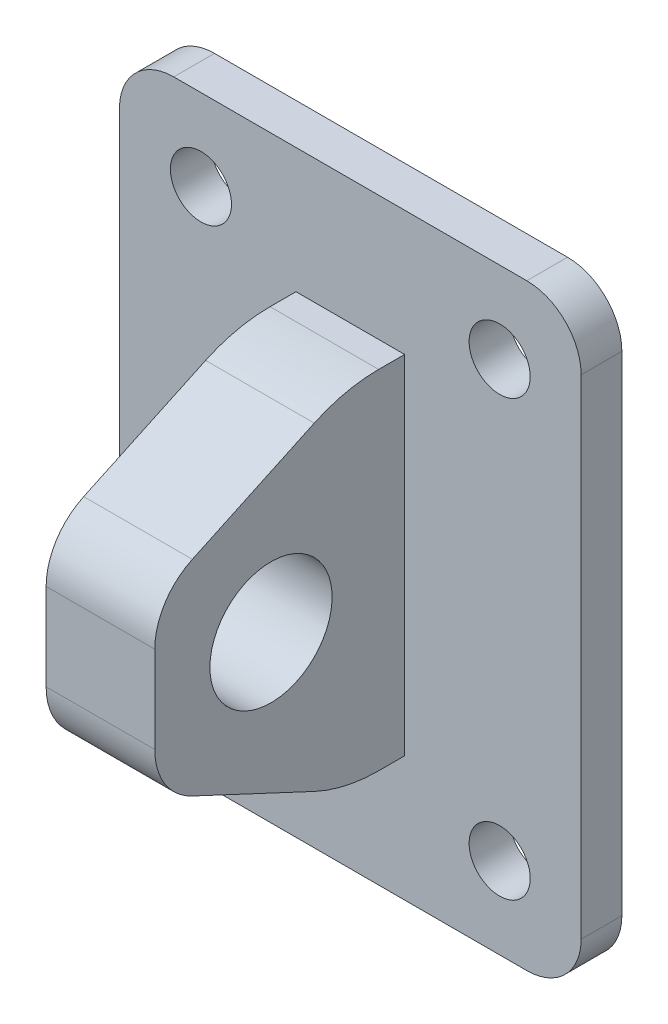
ISO-10303-21;
HEADER;
FILE_DESCRIPTION(('STEP AP214'),'2;1');
FILE_NAME('part.step','',(''),(''),'','','');
FILE_SCHEMA(('AUTOMOTIVE_DESIGN { 1 0 10303 214 1 1 1 1 }'));
ENDSEC;
DATA;
#1=APPLICATION_CONTEXT('core data for automotive mechanical design processes');
#2=APPLICATION_PROTOCOL_DEFINITION('international standard','automotive_design',2000,#1);
#3=PRODUCT_CONTEXT('',#1,'mechanical');
#4=PRODUCT('Part','Part','',(#3));
#5=PRODUCT_RELATED_PRODUCT_CATEGORY('part','',(#4));
#6=PRODUCT_DEFINITION_FORMATION('','',#4);
#7=PRODUCT_DEFINITION_CONTEXT('part definition',#1,'design');
#8=PRODUCT_DEFINITION('design','',#6,#7);
#9=PRODUCT_DEFINITION_SHAPE('','',#8);
#10=(LENGTH_UNIT() NAMED_UNIT(*) SI_UNIT(.MILLI.,.METRE.));
#11=(NAMED_UNIT(*) PLANE_ANGLE_UNIT() SI_UNIT($,.RADIAN.));
#12=(NAMED_UNIT(*) SI_UNIT($,.STERADIAN.) SOLID_ANGLE_UNIT());
#13=UNCERTAINTY_MEASURE_WITH_UNIT(LENGTH_MEASURE(1.E-05),#10,'distance_accuracy_value','');
#14=(GEOMETRIC_REPRESENTATION_CONTEXT(3) GLOBAL_UNCERTAINTY_ASSIGNED_CONTEXT((#13)) GLOBAL_UNIT_ASSIGNED_CONTEXT((#10,
#11,#12)) REPRESENTATION_CONTEXT('',''));
#15=CARTESIAN_POINT('',(0.,0.,0.));
#16=DIRECTION('',(0.,0.,1.));
#17=DIRECTION('',(1.,0.,0.));
#18=AXIS2_PLACEMENT_3D('',#15,#16,#17);
#19=CARTESIAN_POINT('',(53.975,-57.15,0.));
#20=DIRECTION('',(0.,0.,1.));
#21=DIRECTION('',(1.,0.,0.));
#22=AXIS2_PLACEMENT_3D('',#19,#20,#21);
#23=PLANE('',#22);
#24=CARTESIAN_POINT('',(41.275,-57.15,0.));
#25=DIRECTION('',(0.,0.,1.));
#26=DIRECTION('',(1.,0.,0.));
#27=AXIS2_PLACEMENT_3D('',#24,#25,#26);
#28=CIRCLE('',#27,12.7);
#29=CARTESIAN_POINT('',(41.275,-69.85,0.));
#30=VERTEX_POINT('',#29);
#31=CARTESIAN_POINT('',(53.975,-57.15,0.));
#32=VERTEX_POINT('',#31);
#33=EDGE_CURVE('E143',#30,#32,#28,.T.);
#34=ORIENTED_EDGE('',*,*,#33,.T.);
#35=DIRECTION('',(0.,1.,0.));
#36=VECTOR('',#35,1.);
#37=CARTESIAN_POINT('',(53.975,57.15,0.));
#38=LINE('',#37,#36);
#39=CARTESIAN_POINT('',(53.975,57.15,0.));
#40=VERTEX_POINT('',#39);
#41=EDGE_CURVE('E141',#32,#40,#38,.T.);
#42=ORIENTED_EDGE('',*,*,#41,.T.);
#43=CARTESIAN_POINT('',(41.275,57.15,0.));
#44=DIRECTION('',(0.,0.,1.));
#45=DIRECTION('',(-1.,0.,0.));
#46=AXIS2_PLACEMENT_3D('',#43,#44,#45);
#47=CIRCLE('',#46,12.7);
#48=CARTESIAN_POINT('',(41.275,69.85,0.));
#49=VERTEX_POINT('',#48);
#50=EDGE_CURVE('E123',#40,#49,#47,.T.);
#51=ORIENTED_EDGE('',*,*,#50,.T.);
#52=DIRECTION('',(-1.,0.,0.));
#53=VECTOR('',#52,1.);
#54=CARTESIAN_POINT('',(-41.275,69.85,0.));
#55=LINE('',#54,#53);
#56=CARTESIAN_POINT('',(-41.275,69.85,0.));
#57=VERTEX_POINT('',#56);
#58=EDGE_CURVE('E132',#49,#57,#55,.T.);
#59=ORIENTED_EDGE('',*,*,#58,.T.);
#60=CARTESIAN_POINT('',(-41.275,57.15,0.));
#61=DIRECTION('',(0.,0.,1.));
#62=DIRECTION('',(1.,0.,0.));
#63=AXIS2_PLACEMENT_3D('',#60,#61,#62);
#64=CIRCLE('',#63,12.7);
#65=CARTESIAN_POINT('',(-53.975,57.15,0.));
#66=VERTEX_POINT('',#65);
#67=EDGE_CURVE('E137',#57,#66,#64,.T.);
#68=ORIENTED_EDGE('',*,*,#67,.T.);
#69=DIRECTION('',(0.,-1.,0.));
#70=VECTOR('',#69,1.);
#71=CARTESIAN_POINT('',(-53.975,57.15,0.));
#72=LINE('',#71,#70);
#73=CARTESIAN_POINT('',(-53.975,-57.15,0.));
#74=VERTEX_POINT('',#73);
#75=EDGE_CURVE('E266',#66,#74,#72,.T.);
#76=ORIENTED_EDGE('',*,*,#75,.T.);
#77=CARTESIAN_POINT('',(-41.275,-57.15,0.));
#78=DIRECTION('',(0.,0.,1.));
#79=DIRECTION('',(1.,0.,0.));
#80=AXIS2_PLACEMENT_3D('',#77,#78,#79);
#81=CIRCLE('',#80,12.7);
#82=CARTESIAN_POINT('',(-41.275,-69.85,0.));
#83=VERTEX_POINT('',#82);
#84=EDGE_CURVE('E273',#74,#83,#81,.T.);
#85=ORIENTED_EDGE('',*,*,#84,.T.);
#86=DIRECTION('',(1.,0.,0.));
#87=VECTOR('',#86,1.);
#88=CARTESIAN_POINT('',(-41.275,-69.85,0.));
#89=LINE('',#88,#87);
#90=EDGE_CURVE('E167',#83,#30,#89,.T.);
#91=ORIENTED_EDGE('',*,*,#90,.T.);
#92=EDGE_LOOP('',(#34,#42,#51,#59,#68,#76,#85,#91));
#93=FACE_BOUND('',#92,.T.);
#94=CARTESIAN_POINT('',(-34.925,50.8,0.));
#95=DIRECTION('',(0.,0.,1.));
#96=DIRECTION('',(1.,0.,0.));
#97=AXIS2_PLACEMENT_3D('',#94,#95,#96);
#98=CIRCLE('',#97,7.14375);
#99=CARTESIAN_POINT('',(-27.78125,50.8,0.));
#100=VERTEX_POINT('',#99);
#101=EDGE_CURVE('E168',#100,#100,#98,.T.);
#102=ORIENTED_EDGE('',*,*,#101,.F.);
#103=EDGE_LOOP('',(#102));
#104=FACE_BOUND('',#103,.T.);
#105=CARTESIAN_POINT('',(34.925,50.8,0.));
#106=DIRECTION('',(0.,0.,1.));
#107=DIRECTION('',(1.,0.,0.));
#108=AXIS2_PLACEMENT_3D('',#105,#106,#107);
#109=CIRCLE('',#108,7.14375);
#110=CARTESIAN_POINT('',(42.06875,50.8,0.));
#111=VERTEX_POINT('',#110);
#112=EDGE_CURVE('E174',#111,#111,#109,.T.);
#113=ORIENTED_EDGE('',*,*,#112,.F.);
#114=EDGE_LOOP('',(#113));
#115=FACE_BOUND('',#114,.T.);
#116=CARTESIAN_POINT('',(-34.925,-50.8,0.));
#117=DIRECTION('',(0.,0.,1.));
#118=DIRECTION('',(1.,0.,0.));
#119=AXIS2_PLACEMENT_3D('',#116,#117,#118);
#120=CIRCLE('',#119,7.14375);
#121=CARTESIAN_POINT('',(-27.78125,-50.8,0.));
#122=VERTEX_POINT('',#121);
#123=EDGE_CURVE('E180',#122,#122,#120,.T.);
#124=ORIENTED_EDGE('',*,*,#123,.F.);
#125=EDGE_LOOP('',(#124));
#126=FACE_BOUND('',#125,.T.);
#127=CARTESIAN_POINT('',(34.925,-50.8,0.));
#128=DIRECTION('',(0.,0.,1.));
#129=DIRECTION('',(1.,0.,0.));
#130=AXIS2_PLACEMENT_3D('',#127,#128,#129);
#131=CIRCLE('',#130,7.14375);
#132=CARTESIAN_POINT('',(42.06875,-50.8,0.));
#133=VERTEX_POINT('',#132);
#134=EDGE_CURVE('E13',#133,#133,#131,.T.);
#135=ORIENTED_EDGE('',*,*,#134,.F.);
#136=EDGE_LOOP('',(#135));
#137=FACE_BOUND('',#136,.T.);
#138=ADVANCED_FACE('F49',(#93,#104,#115,#126,#137),#23,.T.);
#139=CARTESIAN_POINT('',(41.275,-57.15,-9.525));
#140=DIRECTION('',(0.,0.,1.));
#141=DIRECTION('',(1.,0.,0.));
#142=AXIS2_PLACEMENT_3D('',#139,#140,#141);
#143=CYLINDRICAL_SURFACE('',#142,12.7);
#144=ORIENTED_EDGE('',*,*,#33,.F.);
#145=DIRECTION('',(0.,0.,1.));
#146=VECTOR('',#145,1.);
#147=CARTESIAN_POINT('',(41.275,-69.85,-9.525));
#148=LINE('',#147,#146);
#149=CARTESIAN_POINT('',(41.275,-69.85,-9.525));
#150=VERTEX_POINT('',#149);
#151=EDGE_CURVE('E106',#150,#30,#148,.T.);
#152=ORIENTED_EDGE('',*,*,#151,.F.);
#153=CARTESIAN_POINT('',(41.275,-57.15,-9.525));
#154=DIRECTION('',(0.,0.,1.));
#155=DIRECTION('',(1.,0.,0.));
#156=AXIS2_PLACEMENT_3D('',#153,#154,#155);
#157=CIRCLE('',#156,12.7);
#158=CARTESIAN_POINT('',(53.975,-57.15,-9.525));
#159=VERTEX_POINT('',#158);
#160=EDGE_CURVE('E165',#150,#159,#157,.T.);
#161=ORIENTED_EDGE('',*,*,#160,.T.);
#162=DIRECTION('',(0.,0.,1.));
#163=VECTOR('',#162,1.);
#164=CARTESIAN_POINT('',(53.975,-57.15,-9.525));
#165=LINE('',#164,#163);
#166=EDGE_CURVE('E65',#159,#32,#165,.T.);
#167=ORIENTED_EDGE('',*,*,#166,.T.);
#168=EDGE_LOOP('',(#144,#152,#161,#167));
#169=FACE_BOUND('',#168,.T.);
#170=ADVANCED_FACE('F199',(#169),#143,.T.);
#171=CARTESIAN_POINT('',(-41.275,-69.85,-9.525));
#172=DIRECTION('',(0.,-1.,0.));
#173=DIRECTION('',(0.,0.,-1.));
#174=AXIS2_PLACEMENT_3D('',#171,#172,#173);
#175=PLANE('',#174);
#176=ORIENTED_EDGE('',*,*,#90,.F.);
#177=DIRECTION('',(0.,0.,1.));
#178=VECTOR('',#177,1.);
#179=CARTESIAN_POINT('',(-41.275,-69.85,-9.525));
#180=LINE('',#179,#178);
#181=CARTESIAN_POINT('',(-41.275,-69.85,-9.525));
#182=VERTEX_POINT('',#181);
#183=EDGE_CURVE('E255',#182,#83,#180,.T.);
#184=ORIENTED_EDGE('',*,*,#183,.F.);
#185=DIRECTION('',(1.,0.,0.));
#186=VECTOR('',#185,1.);
#187=CARTESIAN_POINT('',(-41.275,-69.85,-9.525));
#188=LINE('',#187,#186);
#189=EDGE_CURVE('E149',#182,#150,#188,.T.);
#190=ORIENTED_EDGE('',*,*,#189,.T.);
#191=ORIENTED_EDGE('',*,*,#151,.T.);
#192=EDGE_LOOP('',(#176,#184,#190,#191));
#193=FACE_BOUND('',#192,.T.);
#194=ADVANCED_FACE('F208',(#193),#175,.T.);
#195=CARTESIAN_POINT('',(-41.275,-57.15,-9.525));
#196=DIRECTION('',(0.,0.,1.));
#197=DIRECTION('',(1.,0.,0.));
#198=AXIS2_PLACEMENT_3D('',#195,#196,#197);
#199=CYLINDRICAL_SURFACE('',#198,12.7);
#200=ORIENTED_EDGE('',*,*,#84,.F.);
#201=DIRECTION('',(0.,0.,1.));
#202=VECTOR('',#201,1.);
#203=CARTESIAN_POINT('',(-53.975,-57.15,-9.525));
#204=LINE('',#203,#202);
#205=CARTESIAN_POINT('',(-53.975,-57.15,-9.525));
#206=VERTEX_POINT('',#205);
#207=EDGE_CURVE('E259',#206,#74,#204,.T.);
#208=ORIENTED_EDGE('',*,*,#207,.F.);
#209=CARTESIAN_POINT('',(-41.275,-57.15,-9.525));
#210=DIRECTION('',(0.,0.,1.));
#211=DIRECTION('',(1.,0.,0.));
#212=AXIS2_PLACEMENT_3D('',#209,#210,#211);
#213=CIRCLE('',#212,12.7);
#214=EDGE_CURVE('E151',#206,#182,#213,.T.);
#215=ORIENTED_EDGE('',*,*,#214,.T.);
#216=ORIENTED_EDGE('',*,*,#183,.T.);
#217=EDGE_LOOP('',(#200,#208,#215,#216));
#218=FACE_BOUND('',#217,.T.);
#219=ADVANCED_FACE('F213',(#218),#199,.T.);
#220=CARTESIAN_POINT('',(-53.975,57.15,-9.525));
#221=DIRECTION('',(-1.,0.,0.));
#222=DIRECTION('',(0.,0.,1.));
#223=AXIS2_PLACEMENT_3D('',#220,#221,#222);
#224=PLANE('',#223);
#225=ORIENTED_EDGE('',*,*,#75,.F.);
#226=DIRECTION('',(0.,0.,1.));
#227=VECTOR('',#226,1.);
#228=CARTESIAN_POINT('',(-53.975,57.15,-9.525));
#229=LINE('',#228,#227);
#230=CARTESIAN_POINT('',(-53.975,57.15,-9.525));
#231=VERTEX_POINT('',#230);
#232=EDGE_CURVE('E264',#231,#66,#229,.T.);
#233=ORIENTED_EDGE('',*,*,#232,.F.);
#234=DIRECTION('',(0.,-1.,0.));
#235=VECTOR('',#234,1.);
#236=CARTESIAN_POINT('',(-53.975,57.15,-9.525));
#237=LINE('',#236,#235);
#238=EDGE_CURVE('E154',#231,#206,#237,.T.);
#239=ORIENTED_EDGE('',*,*,#238,.T.);
#240=ORIENTED_EDGE('',*,*,#207,.T.);
#241=EDGE_LOOP('',(#225,#233,#239,#240));
#242=FACE_BOUND('',#241,.T.);
#243=ADVANCED_FACE('F226',(#242),#224,.T.);
#244=CARTESIAN_POINT('',(-41.275,57.15,-9.525));
#245=DIRECTION('',(0.,0.,1.));
#246=DIRECTION('',(1.,0.,0.));
#247=AXIS2_PLACEMENT_3D('',#244,#245,#246);
#248=CYLINDRICAL_SURFACE('',#247,12.7);
#249=ORIENTED_EDGE('',*,*,#67,.F.);
#250=DIRECTION('',(0.,0.,1.));
#251=VECTOR('',#250,1.);
#252=CARTESIAN_POINT('',(-41.275,69.85,-9.525));
#253=LINE('',#252,#251);
#254=CARTESIAN_POINT('',(-41.275,69.85,-9.525));
#255=VERTEX_POINT('',#254);
#256=EDGE_CURVE('E129',#255,#57,#253,.T.);
#257=ORIENTED_EDGE('',*,*,#256,.F.);
#258=CARTESIAN_POINT('',(-41.275,57.15,-9.525));
#259=DIRECTION('',(0.,0.,1.));
#260=DIRECTION('',(1.,0.,0.));
#261=AXIS2_PLACEMENT_3D('',#258,#259,#260);
#262=CIRCLE('',#261,12.7);
#263=EDGE_CURVE('E157',#255,#231,#262,.T.);
#264=ORIENTED_EDGE('',*,*,#263,.T.);
#265=ORIENTED_EDGE('',*,*,#232,.T.);
#266=EDGE_LOOP('',(#249,#257,#264,#265));
#267=FACE_BOUND('',#266,.T.);
#268=ADVANCED_FACE('F223',(#267),#248,.T.);
#269=CARTESIAN_POINT('',(-41.275,69.85,-9.525));
#270=DIRECTION('',(0.,1.,0.));
#271=DIRECTION('',(0.,0.,1.));
#272=AXIS2_PLACEMENT_3D('',#269,#270,#271);
#273=PLANE('',#272);
#274=ORIENTED_EDGE('',*,*,#58,.F.);
#275=DIRECTION('',(0.,0.,1.));
#276=VECTOR('',#275,1.);
#277=CARTESIAN_POINT('',(41.275,69.85,-9.525));
#278=LINE('',#277,#276);
#279=CARTESIAN_POINT('',(41.275,69.85,-9.525));
#280=VERTEX_POINT('',#279);
#281=EDGE_CURVE('E119',#280,#49,#278,.T.);
#282=ORIENTED_EDGE('',*,*,#281,.F.);
#283=DIRECTION('',(-1.,0.,0.));
#284=VECTOR('',#283,1.);
#285=CARTESIAN_POINT('',(-41.275,69.85,-9.525));
#286=LINE('',#285,#284);
#287=EDGE_CURVE('E160',#280,#255,#286,.T.);
#288=ORIENTED_EDGE('',*,*,#287,.T.);
#289=ORIENTED_EDGE('',*,*,#256,.T.);
#290=EDGE_LOOP('',(#274,#282,#288,#289));
#291=FACE_BOUND('',#290,.T.);
#292=ADVANCED_FACE('F133',(#291),#273,.T.);
#293=CARTESIAN_POINT('',(41.275,57.15,-9.525));
#294=DIRECTION('',(0.,0.,1.));
#295=DIRECTION('',(1.,0.,0.));
#296=AXIS2_PLACEMENT_3D('',#293,#294,#295);
#297=CYLINDRICAL_SURFACE('',#296,12.7);
#298=ORIENTED_EDGE('',*,*,#50,.F.);
#299=DIRECTION('',(0.,0.,1.));
#300=VECTOR('',#299,1.);
#301=CARTESIAN_POINT('',(53.975,57.15,-9.525));
#302=LINE('',#301,#300);
#303=CARTESIAN_POINT('',(53.975,57.15,-9.525));
#304=VERTEX_POINT('',#303);
#305=EDGE_CURVE('E94',#304,#40,#302,.T.);
#306=ORIENTED_EDGE('',*,*,#305,.F.);
#307=CARTESIAN_POINT('',(41.275,57.15,-9.525));
#308=DIRECTION('',(0.,0.,1.));
#309=DIRECTION('',(-1.,0.,0.));
#310=AXIS2_PLACEMENT_3D('',#307,#308,#309);
#311=CIRCLE('',#310,12.7);
#312=EDGE_CURVE('E125',#304,#280,#311,.T.);
#313=ORIENTED_EDGE('',*,*,#312,.T.);
#314=ORIENTED_EDGE('',*,*,#281,.T.);
#315=EDGE_LOOP('',(#298,#306,#313,#314));
#316=FACE_BOUND('',#315,.T.);
#317=ADVANCED_FACE('F121',(#316),#297,.T.);
#318=CARTESIAN_POINT('',(53.975,57.15,-9.525));
#319=DIRECTION('',(1.,0.,0.));
#320=DIRECTION('',(0.,0.,-1.));
#321=AXIS2_PLACEMENT_3D('',#318,#319,#320);
#322=PLANE('',#321);
#323=ORIENTED_EDGE('',*,*,#41,.F.);
#324=ORIENTED_EDGE('',*,*,#166,.F.);
#325=DIRECTION('',(0.,1.,0.));
#326=VECTOR('',#325,1.);
#327=CARTESIAN_POINT('',(53.975,57.15,-9.525));
#328=LINE('',#327,#326);
#329=EDGE_CURVE('E163',#159,#304,#328,.T.);
#330=ORIENTED_EDGE('',*,*,#329,.T.);
#331=ORIENTED_EDGE('',*,*,#305,.T.);
#332=EDGE_LOOP('',(#323,#324,#330,#331));
#333=FACE_BOUND('',#332,.T.);
#334=ADVANCED_FACE('F216',(#333),#322,.T.);
#335=CARTESIAN_POINT('',(41.275,-57.15,-9.525));
#336=DIRECTION('',(0.,0.,1.));
#337=DIRECTION('',(1.,0.,0.));
#338=AXIS2_PLACEMENT_3D('',#335,#336,#337);
#339=PLANE('',#338);
#340=CARTESIAN_POINT('',(34.925,-50.8,-9.525));
#341=DIRECTION('',(0.,0.,1.));
#342=DIRECTION('',(1.,0.,0.));
#343=AXIS2_PLACEMENT_3D('',#340,#341,#342);
#344=CIRCLE('',#343,7.14375);
#345=CARTESIAN_POINT('',(42.06875,-50.8,-9.525));
#346=VERTEX_POINT('',#345);
#347=EDGE_CURVE('E52',#346,#346,#344,.T.);
#348=ORIENTED_EDGE('',*,*,#347,.T.);
#349=EDGE_LOOP('',(#348));
#350=FACE_BOUND('',#349,.T.);
#351=CARTESIAN_POINT('',(-34.925,-50.8,-9.525));
#352=DIRECTION('',(0.,0.,1.));
#353=DIRECTION('',(1.,0.,0.));
#354=AXIS2_PLACEMENT_3D('',#351,#352,#353);
#355=CIRCLE('',#354,7.14375);
#356=CARTESIAN_POINT('',(-27.78125,-50.8,-9.525));
#357=VERTEX_POINT('',#356);
#358=EDGE_CURVE('E177',#357,#357,#355,.T.);
#359=ORIENTED_EDGE('',*,*,#358,.T.);
#360=EDGE_LOOP('',(#359));
#361=FACE_BOUND('',#360,.T.);
#362=CARTESIAN_POINT('',(34.925,50.8,-9.525));
#363=DIRECTION('',(0.,0.,1.));
#364=DIRECTION('',(1.,0.,0.));
#365=AXIS2_PLACEMENT_3D('',#362,#363,#364);
#366=CIRCLE('',#365,7.14375);
#367=CARTESIAN_POINT('',(42.06875,50.8,-9.525));
#368=VERTEX_POINT('',#367);
#369=EDGE_CURVE('E171',#368,#368,#366,.T.);
#370=ORIENTED_EDGE('',*,*,#369,.T.);
#371=EDGE_LOOP('',(#370));
#372=FACE_BOUND('',#371,.T.);
#373=CARTESIAN_POINT('',(-34.925,50.8,-9.525));
#374=DIRECTION('',(0.,0.,1.));
#375=DIRECTION('',(1.,0.,0.));
#376=AXIS2_PLACEMENT_3D('',#373,#374,#375);
#377=CIRCLE('',#376,7.14375);
#378=CARTESIAN_POINT('',(-27.78125,50.8,-9.525));
#379=VERTEX_POINT('',#378);
#380=EDGE_CURVE('E148',#379,#379,#377,.T.);
#381=ORIENTED_EDGE('',*,*,#380,.T.);
#382=EDGE_LOOP('',(#381));
#383=FACE_BOUND('',#382,.T.);
#384=ORIENTED_EDGE('',*,*,#160,.F.);
#385=ORIENTED_EDGE('',*,*,#189,.F.);
#386=ORIENTED_EDGE('',*,*,#214,.F.);
#387=ORIENTED_EDGE('',*,*,#238,.F.);
#388=ORIENTED_EDGE('',*,*,#263,.F.);
#389=ORIENTED_EDGE('',*,*,#287,.F.);
#390=ORIENTED_EDGE('',*,*,#312,.F.);
#391=ORIENTED_EDGE('',*,*,#329,.F.);
#392=EDGE_LOOP('',(#384,#385,#386,#387,#388,#389,#390,#391));
#393=FACE_BOUND('',#392,.T.);
#394=ADVANCED_FACE('F186',(#350,#361,#372,#383,#393),#339,.F.);
#395=CARTESIAN_POINT('',(-34.925,50.8,-9.525));
#396=DIRECTION('',(0.,0.,1.));
#397=DIRECTION('',(1.,0.,0.));
#398=AXIS2_PLACEMENT_3D('',#395,#396,#397);
#399=CYLINDRICAL_SURFACE('',#398,7.14375);
#400=CARTESIAN_POINT('',(-27.78125,50.8,-9.525));
#401=CARTESIAN_POINT('',(-27.78125,50.8,-9.42578125));
#402=CARTESIAN_POINT('',(-27.78125,50.8,-9.3265625));
#403=CARTESIAN_POINT('',(-27.78125,50.8,-9.128125));
#404=CARTESIAN_POINT('',(-27.78125,50.8,-9.02890625));
#405=CARTESIAN_POINT('',(-27.78125,50.8,-8.83046875));
#406=CARTESIAN_POINT('',(-27.78125,50.8,-8.73125));
#407=CARTESIAN_POINT('',(-27.78125,50.8,-8.5328125));
#408=CARTESIAN_POINT('',(-27.78125,50.8,-8.43359375));
#409=CARTESIAN_POINT('',(-27.78125,50.8,-8.23515625));
#410=CARTESIAN_POINT('',(-27.78125,50.8,-8.1359375));
#411=CARTESIAN_POINT('',(-27.78125,50.8,-7.9375));
#412=CARTESIAN_POINT('',(-27.78125,50.8,-7.83828125));
#413=CARTESIAN_POINT('',(-27.78125,50.8,-7.63984375));
#414=CARTESIAN_POINT('',(-27.78125,50.8,-7.540625));
#415=CARTESIAN_POINT('',(-27.78125,50.8,-7.3421875));
#416=CARTESIAN_POINT('',(-27.78125,50.8,-7.24296875));
#417=CARTESIAN_POINT('',(-27.78125,50.8,-7.04453125));
#418=CARTESIAN_POINT('',(-27.78125,50.8,-6.9453125));
#419=CARTESIAN_POINT('',(-27.78125,50.8,-6.746875));
#420=CARTESIAN_POINT('',(-27.78125,50.8,-6.64765625));
#421=CARTESIAN_POINT('',(-27.78125,50.8,-6.44921875));
#422=CARTESIAN_POINT('',(-27.78125,50.8,-6.35));
#423=CARTESIAN_POINT('',(-27.78125,50.8,-6.1515625));
#424=CARTESIAN_POINT('',(-27.78125,50.8,-6.05234375));
#425=CARTESIAN_POINT('',(-27.78125,50.8,-5.85390625));
#426=CARTESIAN_POINT('',(-27.78125,50.8,-5.7546875));
#427=CARTESIAN_POINT('',(-27.78125,50.8,-5.55625));
#428=CARTESIAN_POINT('',(-27.78125,50.8,-5.45703125));
#429=CARTESIAN_POINT('',(-27.78125,50.8,-5.25859375));
#430=CARTESIAN_POINT('',(-27.78125,50.8,-5.159375));
#431=CARTESIAN_POINT('',(-27.78125,50.8,-4.9609375));
#432=CARTESIAN_POINT('',(-27.78125,50.8,-4.86171875));
#433=CARTESIAN_POINT('',(-27.78125,50.8,-4.66328125));
#434=CARTESIAN_POINT('',(-27.78125,50.8,-4.5640625));
#435=CARTESIAN_POINT('',(-27.78125,50.8,-4.365625));
#436=CARTESIAN_POINT('',(-27.78125,50.8,-4.26640625));
#437=CARTESIAN_POINT('',(-27.78125,50.8,-4.06796875));
#438=CARTESIAN_POINT('',(-27.78125,50.8,-3.96875));
#439=CARTESIAN_POINT('',(-27.78125,50.8,-3.7703125));
#440=CARTESIAN_POINT('',(-27.78125,50.8,-3.67109375));
#441=CARTESIAN_POINT('',(-27.78125,50.8,-3.47265625));
#442=CARTESIAN_POINT('',(-27.78125,50.8,-3.3734375));
#443=CARTESIAN_POINT('',(-27.78125,50.8,-3.175));
#444=CARTESIAN_POINT('',(-27.78125,50.8,-3.07578125));
#445=CARTESIAN_POINT('',(-27.78125,50.8,-2.87734375));
#446=CARTESIAN_POINT('',(-27.78125,50.8,-2.778125));
#447=CARTESIAN_POINT('',(-27.78125,50.8,-2.5796875));
#448=CARTESIAN_POINT('',(-27.78125,50.8,-2.48046875));
#449=CARTESIAN_POINT('',(-27.78125,50.8,-2.28203125));
#450=CARTESIAN_POINT('',(-27.78125,50.8,-2.1828125));
#451=CARTESIAN_POINT('',(-27.78125,50.8,-1.984375));
#452=CARTESIAN_POINT('',(-27.78125,50.8,-1.88515625));
#453=CARTESIAN_POINT('',(-27.78125,50.8,-1.68671875));
#454=CARTESIAN_POINT('',(-27.78125,50.8,-1.5875));
#455=CARTESIAN_POINT('',(-27.78125,50.8,-1.3890625));
#456=CARTESIAN_POINT('',(-27.78125,50.8,-1.28984375));
#457=CARTESIAN_POINT('',(-27.78125,50.8,-1.09140625));
#458=CARTESIAN_POINT('',(-27.78125,50.8,-0.992187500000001));
#459=CARTESIAN_POINT('',(-27.78125,50.8,-0.793750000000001));
#460=CARTESIAN_POINT('',(-27.78125,50.8,-0.69453125));
#461=CARTESIAN_POINT('',(-27.78125,50.8,-0.49609375));
#462=CARTESIAN_POINT('',(-27.78125,50.8,-0.396875));
#463=CARTESIAN_POINT('',(-27.78125,50.8,-0.1984375));
#464=CARTESIAN_POINT('',(-27.78125,50.8,-0.0992187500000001));
#465=CARTESIAN_POINT('',(-27.78125,50.8,0.));
#466=B_SPLINE_CURVE_WITH_KNOTS('',3,(#400,#401,#402,#403,#404,#405,#406,#407,#408,#409,#410,
#411,#412,#413,#414,#415,#416,#417,#418,#419,#420,#421,#422,#423,#424,#425,#426,#427,#428,#429,
#430,#431,#432,#433,#434,#435,#436,#437,#438,#439,#440,#441,#442,#443,#444,#445,#446,#447,#448,
#449,#450,#451,#452,#453,#454,#455,#456,#457,#458,#459,#460,#461,#462,#463,#464,#465),
.UNSPECIFIED.,.F.,.F.,(4,2,2,2,2,2,2,2,2,2,2,2,2,2,2,2,2,2,2,2,2,2,2,2,2,2,2,2,2,2,2,2,4),(0.,
0.297656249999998,0.595312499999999,0.892968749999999,1.190625,1.48828125,1.7859375,2.08359375,
2.38125,2.67890625,2.9765625,3.27421875,3.571875,3.86953125,4.1671875,4.46484375,4.7625,
5.06015625,5.3578125,5.65546875,5.953125,6.25078125,6.5484375,6.84609375,7.14375,7.44140625,
7.7390625,8.03671875,8.334375,8.63203125,8.9296875,9.22734375,9.525),.UNSPECIFIED.);
#467=EDGE_CURVE('BSEAM236',#379,#100,#466,.T.);
#468=ORIENTED_EDGE('',*,*,#380,.F.);
#469=ORIENTED_EDGE('',*,*,#101,.T.);
#470=ORIENTED_EDGE('',*,*,#467,.T.);
#471=ORIENTED_EDGE('',*,*,#467,.F.);
#472=EDGE_LOOP('',(#468,#470,#469,#471));
#473=FACE_BOUND('',#472,.T.);
#474=ADVANCED_FACE('F236',(#473),#399,.F.);
#475=CARTESIAN_POINT('',(34.925,50.8,-9.525));
#476=DIRECTION('',(0.,0.,1.));
#477=DIRECTION('',(1.,0.,0.));
#478=AXIS2_PLACEMENT_3D('',#475,#476,#477);
#479=CYLINDRICAL_SURFACE('',#478,7.14375);
#480=CARTESIAN_POINT('',(42.06875,50.8,-9.525));
#481=CARTESIAN_POINT('',(42.06875,50.8,-9.42578125));
#482=CARTESIAN_POINT('',(42.06875,50.8,-9.3265625));
#483=CARTESIAN_POINT('',(42.06875,50.8,-9.128125));
#484=CARTESIAN_POINT('',(42.06875,50.8,-9.02890625));
#485=CARTESIAN_POINT('',(42.06875,50.8,-8.83046875));
#486=CARTESIAN_POINT('',(42.06875,50.8,-8.73125));
#487=CARTESIAN_POINT('',(42.06875,50.8,-8.5328125));
#488=CARTESIAN_POINT('',(42.06875,50.8,-8.43359375));
#489=CARTESIAN_POINT('',(42.06875,50.8,-8.23515625));
#490=CARTESIAN_POINT('',(42.06875,50.8,-8.1359375));
#491=CARTESIAN_POINT('',(42.06875,50.8,-7.9375));
#492=CARTESIAN_POINT('',(42.06875,50.8,-7.83828125));
#493=CARTESIAN_POINT('',(42.06875,50.8,-7.63984375));
#494=CARTESIAN_POINT('',(42.06875,50.8,-7.540625));
#495=CARTESIAN_POINT('',(42.06875,50.8,-7.3421875));
#496=CARTESIAN_POINT('',(42.06875,50.8,-7.24296875));
#497=CARTESIAN_POINT('',(42.06875,50.8,-7.04453125));
#498=CARTESIAN_POINT('',(42.06875,50.8,-6.9453125));
#499=CARTESIAN_POINT('',(42.06875,50.8,-6.746875));
#500=CARTESIAN_POINT('',(42.06875,50.8,-6.64765625));
#501=CARTESIAN_POINT('',(42.06875,50.8,-6.44921875));
#502=CARTESIAN_POINT('',(42.06875,50.8,-6.35));
#503=CARTESIAN_POINT('',(42.06875,50.8,-6.1515625));
#504=CARTESIAN_POINT('',(42.06875,50.8,-6.05234375));
#505=CARTESIAN_POINT('',(42.06875,50.8,-5.85390625));
#506=CARTESIAN_POINT('',(42.06875,50.8,-5.7546875));
#507=CARTESIAN_POINT('',(42.06875,50.8,-5.55625));
#508=CARTESIAN_POINT('',(42.06875,50.8,-5.45703125));
#509=CARTESIAN_POINT('',(42.06875,50.8,-5.25859375));
#510=CARTESIAN_POINT('',(42.06875,50.8,-5.159375));
#511=CARTESIAN_POINT('',(42.06875,50.8,-4.9609375));
#512=CARTESIAN_POINT('',(42.06875,50.8,-4.86171875));
#513=CARTESIAN_POINT('',(42.06875,50.8,-4.66328125));
#514=CARTESIAN_POINT('',(42.06875,50.8,-4.5640625));
#515=CARTESIAN_POINT('',(42.06875,50.8,-4.365625));
#516=CARTESIAN_POINT('',(42.06875,50.8,-4.26640625));
#517=CARTESIAN_POINT('',(42.06875,50.8,-4.06796875));
#518=CARTESIAN_POINT('',(42.06875,50.8,-3.96875));
#519=CARTESIAN_POINT('',(42.06875,50.8,-3.7703125));
#520=CARTESIAN_POINT('',(42.06875,50.8,-3.67109375));
#521=CARTESIAN_POINT('',(42.06875,50.8,-3.47265625));
#522=CARTESIAN_POINT('',(42.06875,50.8,-3.3734375));
#523=CARTESIAN_POINT('',(42.06875,50.8,-3.175));
#524=CARTESIAN_POINT('',(42.06875,50.8,-3.07578125));
#525=CARTESIAN_POINT('',(42.06875,50.8,-2.87734375));
#526=CARTESIAN_POINT('',(42.06875,50.8,-2.778125));
#527=CARTESIAN_POINT('',(42.06875,50.8,-2.5796875));
#528=CARTESIAN_POINT('',(42.06875,50.8,-2.48046875));
#529=CARTESIAN_POINT('',(42.06875,50.8,-2.28203125));
#530=CARTESIAN_POINT('',(42.06875,50.8,-2.1828125));
#531=CARTESIAN_POINT('',(42.06875,50.8,-1.984375));
#532=CARTESIAN_POINT('',(42.06875,50.8,-1.88515625));
#533=CARTESIAN_POINT('',(42.06875,50.8,-1.68671875));
#534=CARTESIAN_POINT('',(42.06875,50.8,-1.5875));
#535=CARTESIAN_POINT('',(42.06875,50.8,-1.3890625));
#536=CARTESIAN_POINT('',(42.06875,50.8,-1.28984375));
#537=CARTESIAN_POINT('',(42.06875,50.8,-1.09140625));
#538=CARTESIAN_POINT('',(42.06875,50.8,-0.992187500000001));
#539=CARTESIAN_POINT('',(42.06875,50.8,-0.793750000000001));
#540=CARTESIAN_POINT('',(42.06875,50.8,-0.69453125));
#541=CARTESIAN_POINT('',(42.06875,50.8,-0.49609375));
#542=CARTESIAN_POINT('',(42.06875,50.8,-0.396875));
#543=CARTESIAN_POINT('',(42.06875,50.8,-0.1984375));
#544=CARTESIAN_POINT('',(42.06875,50.8,-0.0992187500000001));
#545=CARTESIAN_POINT('',(42.06875,50.8,0.));
#546=B_SPLINE_CURVE_WITH_KNOTS('',3,(#480,#481,#482,#483,#484,#485,#486,#487,#488,#489,#490,
#491,#492,#493,#494,#495,#496,#497,#498,#499,#500,#501,#502,#503,#504,#505,#506,#507,#508,#509,
#510,#511,#512,#513,#514,#515,#516,#517,#518,#519,#520,#521,#522,#523,#524,#525,#526,#527,#528,
#529,#530,#531,#532,#533,#534,#535,#536,#537,#538,#539,#540,#541,#542,#543,#544,#545),
.UNSPECIFIED.,.F.,.F.,(4,2,2,2,2,2,2,2,2,2,2,2,2,2,2,2,2,2,2,2,2,2,2,2,2,2,2,2,2,2,2,2,4),(0.,
0.297656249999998,0.595312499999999,0.892968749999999,1.190625,1.48828125,1.7859375,2.08359375,
2.38125,2.67890625,2.9765625,3.27421875,3.571875,3.86953125,4.1671875,4.46484375,4.7625,
5.06015625,5.3578125,5.65546875,5.953125,6.25078125,6.5484375,6.84609375,7.14375,7.44140625,
7.7390625,8.03671875,8.334375,8.63203125,8.9296875,9.22734375,9.525),.UNSPECIFIED.);
#547=EDGE_CURVE('BSEAM193',#368,#111,#546,.T.);
#548=ORIENTED_EDGE('',*,*,#369,.F.);
#549=ORIENTED_EDGE('',*,*,#112,.T.);
#550=ORIENTED_EDGE('',*,*,#547,.T.);
#551=ORIENTED_EDGE('',*,*,#547,.F.);
#552=EDGE_LOOP('',(#548,#550,#549,#551));
#553=FACE_BOUND('',#552,.T.);
#554=ADVANCED_FACE('F193',(#553),#479,.F.);
#555=CARTESIAN_POINT('',(-34.925,-50.8,-9.525));
#556=DIRECTION('',(0.,0.,1.));
#557=DIRECTION('',(1.,0.,0.));
#558=AXIS2_PLACEMENT_3D('',#555,#556,#557);
#559=CYLINDRICAL_SURFACE('',#558,7.14375);
#560=CARTESIAN_POINT('',(-27.78125,-50.8,-9.525));
#561=CARTESIAN_POINT('',(-27.78125,-50.8,-9.42578125));
#562=CARTESIAN_POINT('',(-27.78125,-50.8,-9.3265625));
#563=CARTESIAN_POINT('',(-27.78125,-50.8,-9.128125));
#564=CARTESIAN_POINT('',(-27.78125,-50.8,-9.02890625));
#565=CARTESIAN_POINT('',(-27.78125,-50.8,-8.83046875));
#566=CARTESIAN_POINT('',(-27.78125,-50.8,-8.73125));
#567=CARTESIAN_POINT('',(-27.78125,-50.8,-8.5328125));
#568=CARTESIAN_POINT('',(-27.78125,-50.8,-8.43359375));
#569=CARTESIAN_POINT('',(-27.78125,-50.8,-8.23515625));
#570=CARTESIAN_POINT('',(-27.78125,-50.8,-8.1359375));
#571=CARTESIAN_POINT('',(-27.78125,-50.8,-7.9375));
#572=CARTESIAN_POINT('',(-27.78125,-50.8,-7.83828125));
#573=CARTESIAN_POINT('',(-27.78125,-50.8,-7.63984375));
#574=CARTESIAN_POINT('',(-27.78125,-50.8,-7.540625));
#575=CARTESIAN_POINT('',(-27.78125,-50.8,-7.3421875));
#576=CARTESIAN_POINT('',(-27.78125,-50.8,-7.24296875));
#577=CARTESIAN_POINT('',(-27.78125,-50.8,-7.04453125));
#578=CARTESIAN_POINT('',(-27.78125,-50.8,-6.9453125));
#579=CARTESIAN_POINT('',(-27.78125,-50.8,-6.746875));
#580=CARTESIAN_POINT('',(-27.78125,-50.8,-6.64765625));
#581=CARTESIAN_POINT('',(-27.78125,-50.8,-6.44921875));
#582=CARTESIAN_POINT('',(-27.78125,-50.8,-6.35));
#583=CARTESIAN_POINT('',(-27.78125,-50.8,-6.1515625));
#584=CARTESIAN_POINT('',(-27.78125,-50.8,-6.05234375));
#585=CARTESIAN_POINT('',(-27.78125,-50.8,-5.85390625));
#586=CARTESIAN_POINT('',(-27.78125,-50.8,-5.7546875));
#587=CARTESIAN_POINT('',(-27.78125,-50.8,-5.55625));
#588=CARTESIAN_POINT('',(-27.78125,-50.8,-5.45703125));
#589=CARTESIAN_POINT('',(-27.78125,-50.8,-5.25859375));
#590=CARTESIAN_POINT('',(-27.78125,-50.8,-5.159375));
#591=CARTESIAN_POINT('',(-27.78125,-50.8,-4.9609375));
#592=CARTESIAN_POINT('',(-27.78125,-50.8,-4.86171875));
#593=CARTESIAN_POINT('',(-27.78125,-50.8,-4.66328125));
#594=CARTESIAN_POINT('',(-27.78125,-50.8,-4.5640625));
#595=CARTESIAN_POINT('',(-27.78125,-50.8,-4.365625));
#596=CARTESIAN_POINT('',(-27.78125,-50.8,-4.26640625));
#597=CARTESIAN_POINT('',(-27.78125,-50.8,-4.06796875));
#598=CARTESIAN_POINT('',(-27.78125,-50.8,-3.96875));
#599=CARTESIAN_POINT('',(-27.78125,-50.8,-3.7703125));
#600=CARTESIAN_POINT('',(-27.78125,-50.8,-3.67109375));
#601=CARTESIAN_POINT('',(-27.78125,-50.8,-3.47265625));
#602=CARTESIAN_POINT('',(-27.78125,-50.8,-3.3734375));
#603=CARTESIAN_POINT('',(-27.78125,-50.8,-3.175));
#604=CARTESIAN_POINT('',(-27.78125,-50.8,-3.07578125));
#605=CARTESIAN_POINT('',(-27.78125,-50.8,-2.87734375));
#606=CARTESIAN_POINT('',(-27.78125,-50.8,-2.778125));
#607=CARTESIAN_POINT('',(-27.78125,-50.8,-2.5796875));
#608=CARTESIAN_POINT('',(-27.78125,-50.8,-2.48046875));
#609=CARTESIAN_POINT('',(-27.78125,-50.8,-2.28203125));
#610=CARTESIAN_POINT('',(-27.78125,-50.8,-2.1828125));
#611=CARTESIAN_POINT('',(-27.78125,-50.8,-1.984375));
#612=CARTESIAN_POINT('',(-27.78125,-50.8,-1.88515625));
#613=CARTESIAN_POINT('',(-27.78125,-50.8,-1.68671875));
#614=CARTESIAN_POINT('',(-27.78125,-50.8,-1.5875));
#615=CARTESIAN_POINT('',(-27.78125,-50.8,-1.3890625));
#616=CARTESIAN_POINT('',(-27.78125,-50.8,-1.28984375));
#617=CARTESIAN_POINT('',(-27.78125,-50.8,-1.09140625));
#618=CARTESIAN_POINT('',(-27.78125,-50.8,-0.992187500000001));
#619=CARTESIAN_POINT('',(-27.78125,-50.8,-0.793750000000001));
#620=CARTESIAN_POINT('',(-27.78125,-50.8,-0.69453125));
#621=CARTESIAN_POINT('',(-27.78125,-50.8,-0.49609375));
#622=CARTESIAN_POINT('',(-27.78125,-50.8,-0.396875));
#623=CARTESIAN_POINT('',(-27.78125,-50.8,-0.1984375));
#624=CARTESIAN_POINT('',(-27.78125,-50.8,-0.0992187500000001));
#625=CARTESIAN_POINT('',(-27.78125,-50.8,0.));
#626=B_SPLINE_CURVE_WITH_KNOTS('',3,(#560,#561,#562,#563,#564,#565,#566,#567,#568,#569,#570,
#571,#572,#573,#574,#575,#576,#577,#578,#579,#580,#581,#582,#583,#584,#585,#586,#587,#588,#589,
#590,#591,#592,#593,#594,#595,#596,#597,#598,#599,#600,#601,#602,#603,#604,#605,#606,#607,#608,
#609,#610,#611,#612,#613,#614,#615,#616,#617,#618,#619,#620,#621,#622,#623,#624,#625),
.UNSPECIFIED.,.F.,.F.,(4,2,2,2,2,2,2,2,2,2,2,2,2,2,2,2,2,2,2,2,2,2,2,2,2,2,2,2,2,2,2,2,4),(0.,
0.297656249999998,0.595312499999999,0.892968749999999,1.190625,1.48828125,1.7859375,2.08359375,
2.38125,2.67890625,2.9765625,3.27421875,3.571875,3.86953125,4.1671875,4.46484375,4.7625,
5.06015625,5.3578125,5.65546875,5.953125,6.25078125,6.5484375,6.84609375,7.14375,7.44140625,
7.7390625,8.03671875,8.334375,8.63203125,8.9296875,9.22734375,9.525),.UNSPECIFIED.);
#627=EDGE_CURVE('BSEAM189',#357,#122,#626,.T.);
#628=ORIENTED_EDGE('',*,*,#358,.F.);
#629=ORIENTED_EDGE('',*,*,#123,.T.);
#630=ORIENTED_EDGE('',*,*,#627,.T.);
#631=ORIENTED_EDGE('',*,*,#627,.F.);
#632=EDGE_LOOP('',(#628,#630,#629,#631));
#633=FACE_BOUND('',#632,.T.);
#634=ADVANCED_FACE('F189',(#633),#559,.F.);
#635=CARTESIAN_POINT('',(34.925,-50.8,-9.525));
#636=DIRECTION('',(0.,0.,1.));
#637=DIRECTION('',(1.,0.,0.));
#638=AXIS2_PLACEMENT_3D('',#635,#636,#637);
#639=CYLINDRICAL_SURFACE('',#638,7.14375);
#640=CARTESIAN_POINT('',(42.06875,-50.8,-9.525));
#641=CARTESIAN_POINT('',(42.06875,-50.8,-9.42578125));
#642=CARTESIAN_POINT('',(42.06875,-50.8,-9.3265625));
#643=CARTESIAN_POINT('',(42.06875,-50.8,-9.128125));
#644=CARTESIAN_POINT('',(42.06875,-50.8,-9.02890625));
#645=CARTESIAN_POINT('',(42.06875,-50.8,-8.83046875));
#646=CARTESIAN_POINT('',(42.06875,-50.8,-8.73125));
#647=CARTESIAN_POINT('',(42.06875,-50.8,-8.5328125));
#648=CARTESIAN_POINT('',(42.06875,-50.8,-8.43359375));
#649=CARTESIAN_POINT('',(42.06875,-50.8,-8.23515625));
#650=CARTESIAN_POINT('',(42.06875,-50.8,-8.1359375));
#651=CARTESIAN_POINT('',(42.06875,-50.8,-7.9375));
#652=CARTESIAN_POINT('',(42.06875,-50.8,-7.83828125));
#653=CARTESIAN_POINT('',(42.06875,-50.8,-7.63984375));
#654=CARTESIAN_POINT('',(42.06875,-50.8,-7.540625));
#655=CARTESIAN_POINT('',(42.06875,-50.8,-7.3421875));
#656=CARTESIAN_POINT('',(42.06875,-50.8,-7.24296875));
#657=CARTESIAN_POINT('',(42.06875,-50.8,-7.04453125));
#658=CARTESIAN_POINT('',(42.06875,-50.8,-6.9453125));
#659=CARTESIAN_POINT('',(42.06875,-50.8,-6.746875));
#660=CARTESIAN_POINT('',(42.06875,-50.8,-6.64765625));
#661=CARTESIAN_POINT('',(42.06875,-50.8,-6.44921875));
#662=CARTESIAN_POINT('',(42.06875,-50.8,-6.35));
#663=CARTESIAN_POINT('',(42.06875,-50.8,-6.1515625));
#664=CARTESIAN_POINT('',(42.06875,-50.8,-6.05234375));
#665=CARTESIAN_POINT('',(42.06875,-50.8,-5.85390625));
#666=CARTESIAN_POINT('',(42.06875,-50.8,-5.7546875));
#667=CARTESIAN_POINT('',(42.06875,-50.8,-5.55625));
#668=CARTESIAN_POINT('',(42.06875,-50.8,-5.45703125));
#669=CARTESIAN_POINT('',(42.06875,-50.8,-5.25859375));
#670=CARTESIAN_POINT('',(42.06875,-50.8,-5.159375));
#671=CARTESIAN_POINT('',(42.06875,-50.8,-4.9609375));
#672=CARTESIAN_POINT('',(42.06875,-50.8,-4.86171875));
#673=CARTESIAN_POINT('',(42.06875,-50.8,-4.66328125));
#674=CARTESIAN_POINT('',(42.06875,-50.8,-4.5640625));
#675=CARTESIAN_POINT('',(42.06875,-50.8,-4.365625));
#676=CARTESIAN_POINT('',(42.06875,-50.8,-4.26640625));
#677=CARTESIAN_POINT('',(42.06875,-50.8,-4.06796875));
#678=CARTESIAN_POINT('',(42.06875,-50.8,-3.96875));
#679=CARTESIAN_POINT('',(42.06875,-50.8,-3.7703125));
#680=CARTESIAN_POINT('',(42.06875,-50.8,-3.67109375));
#681=CARTESIAN_POINT('',(42.06875,-50.8,-3.47265625));
#682=CARTESIAN_POINT('',(42.06875,-50.8,-3.3734375));
#683=CARTESIAN_POINT('',(42.06875,-50.8,-3.175));
#684=CARTESIAN_POINT('',(42.06875,-50.8,-3.07578125));
#685=CARTESIAN_POINT('',(42.06875,-50.8,-2.87734375));
#686=CARTESIAN_POINT('',(42.06875,-50.8,-2.778125));
#687=CARTESIAN_POINT('',(42.06875,-50.8,-2.5796875));
#688=CARTESIAN_POINT('',(42.06875,-50.8,-2.48046875));
#689=CARTESIAN_POINT('',(42.06875,-50.8,-2.28203125));
#690=CARTESIAN_POINT('',(42.06875,-50.8,-2.1828125));
#691=CARTESIAN_POINT('',(42.06875,-50.8,-1.984375));
#692=CARTESIAN_POINT('',(42.06875,-50.8,-1.88515625));
#693=CARTESIAN_POINT('',(42.06875,-50.8,-1.68671875));
#694=CARTESIAN_POINT('',(42.06875,-50.8,-1.5875));
#695=CARTESIAN_POINT('',(42.06875,-50.8,-1.3890625));
#696=CARTESIAN_POINT('',(42.06875,-50.8,-1.28984375));
#697=CARTESIAN_POINT('',(42.06875,-50.8,-1.09140625));
#698=CARTESIAN_POINT('',(42.06875,-50.8,-0.992187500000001));
#699=CARTESIAN_POINT('',(42.06875,-50.8,-0.793750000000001));
#700=CARTESIAN_POINT('',(42.06875,-50.8,-0.69453125));
#701=CARTESIAN_POINT('',(42.06875,-50.8,-0.49609375));
#702=CARTESIAN_POINT('',(42.06875,-50.8,-0.396875));
#703=CARTESIAN_POINT('',(42.06875,-50.8,-0.1984375));
#704=CARTESIAN_POINT('',(42.06875,-50.8,-0.0992187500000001));
#705=CARTESIAN_POINT('',(42.06875,-50.8,0.));
#706=B_SPLINE_CURVE_WITH_KNOTS('',3,(#640,#641,#642,#643,#644,#645,#646,#647,#648,#649,#650,
#651,#652,#653,#654,#655,#656,#657,#658,#659,#660,#661,#662,#663,#664,#665,#666,#667,#668,#669,
#670,#671,#672,#673,#674,#675,#676,#677,#678,#679,#680,#681,#682,#683,#684,#685,#686,#687,#688,
#689,#690,#691,#692,#693,#694,#695,#696,#697,#698,#699,#700,#701,#702,#703,#704,#705),
.UNSPECIFIED.,.F.,.F.,(4,2,2,2,2,2,2,2,2,2,2,2,2,2,2,2,2,2,2,2,2,2,2,2,2,2,2,2,2,2,2,2,4),(0.,
0.297656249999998,0.595312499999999,0.892968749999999,1.190625,1.48828125,1.7859375,2.08359375,
2.38125,2.67890625,2.9765625,3.27421875,3.571875,3.86953125,4.1671875,4.46484375,4.7625,
5.06015625,5.3578125,5.65546875,5.953125,6.25078125,6.5484375,6.84609375,7.14375,7.44140625,
7.7390625,8.03671875,8.334375,8.63203125,8.9296875,9.22734375,9.525),.UNSPECIFIED.);
#707=EDGE_CURVE('BSEAM192',#346,#133,#706,.T.);
#708=ORIENTED_EDGE('',*,*,#347,.F.);
#709=ORIENTED_EDGE('',*,*,#134,.T.);
#710=ORIENTED_EDGE('',*,*,#707,.T.);
#711=ORIENTED_EDGE('',*,*,#707,.F.);
#712=EDGE_LOOP('',(#708,#710,#709,#711));
#713=FACE_BOUND('',#712,.T.);
#714=ADVANCED_FACE('F192',(#713),#639,.F.);
#715=CLOSED_SHELL('',(#138,#170,#194,#219,#243,#268,#292,#317,#334,#394,#474,#554,#634,#714));
#716=MANIFOLD_SOLID_BREP('B2',#715);
#717=CARTESIAN_POINT('',(53.975,-57.15,0.));
#718=DIRECTION('',(0.,0.,1.));
#719=DIRECTION('',(1.,0.,0.));
#720=AXIS2_PLACEMENT_3D('',#717,#718,#719);
#721=PLANE('',#720);
#722=DIRECTION('',(0.,-1.,0.));
#723=VECTOR('',#722,1.);
#724=CARTESIAN_POINT('',(12.7,40.64,-4.16333634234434E-13));
#725=LINE('',#724,#723);
#726=CARTESIAN_POINT('',(12.7,40.64,0.));
#727=VERTEX_POINT('',#726);
#728=CARTESIAN_POINT('',(12.7,-40.64,0.));
#729=VERTEX_POINT('',#728);
#730=EDGE_CURVE('E47',#727,#729,#725,.T.);
#731=ORIENTED_EDGE('',*,*,#730,.T.);
#732=DIRECTION('',(-1.,0.,0.));
#733=VECTOR('',#732,1.);
#734=CARTESIAN_POINT('',(12.7,-40.64,4.26741975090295E-13));
#735=LINE('',#734,#733);
#736=CARTESIAN_POINT('',(-12.7,-40.64,4.26741975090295E-13));
#737=VERTEX_POINT('',#736);
#738=EDGE_CURVE('E399',#729,#737,#735,.T.);
#739=ORIENTED_EDGE('',*,*,#738,.T.);
#740=DIRECTION('',(0.,-1.,0.));
#741=VECTOR('',#740,1.);
#742=CARTESIAN_POINT('',(-12.7,40.64,-4.16333634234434E-13));
#743=LINE('',#742,#741);
#744=CARTESIAN_POINT('',(-12.7,40.6400000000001,0.));
#745=VERTEX_POINT('',#744);
#746=EDGE_CURVE('E509',#745,#737,#743,.T.);
#747=ORIENTED_EDGE('',*,*,#746,.F.);
#748=DIRECTION('',(-1.,0.,0.));
#749=VECTOR('',#748,1.);
#750=CARTESIAN_POINT('',(12.7,40.64,-4.16333634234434E-13));
#751=LINE('',#750,#749);
#752=EDGE_CURVE('E406',#727,#745,#751,.T.);
#753=ORIENTED_EDGE('',*,*,#752,.F.);
#754=EDGE_LOOP('',(#731,#739,#747,#753));
#755=FACE_BOUND('',#754,.T.);
#756=ADVANCED_FACE('F391',(#755),#721,.F.);
#757=CARTESIAN_POINT('',(12.7,3.27452190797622E-13,31.242));
#758=DIRECTION('',(-1.,0.,0.));
#759=DIRECTION('',(0.,0.,1.));
#760=AXIS2_PLACEMENT_3D('',#757,#758,#759);
#761=CYLINDRICAL_SURFACE('',#760,14.2875);
#762=CARTESIAN_POINT('',(12.7,3.27452190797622E-13,31.242));
#763=DIRECTION('',(-1.,0.,0.));
#764=DIRECTION('',(0.,0.,1.));
#765=AXIS2_PLACEMENT_3D('',#762,#763,#764);
#766=CIRCLE('',#765,14.2875);
#767=CARTESIAN_POINT('',(12.7,3.27452190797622E-13,45.5295));
#768=VERTEX_POINT('',#767);
#769=EDGE_CURVE('E517',#768,#768,#766,.T.);
#770=ORIENTED_EDGE('',*,*,#769,.F.);
#771=EDGE_LOOP('',(#770));
#772=FACE_BOUND('',#771,.T.);
#773=CARTESIAN_POINT('',(-12.7,3.27452190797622E-13,31.242));
#774=DIRECTION('',(-1.,0.,0.));
#775=DIRECTION('',(0.,0.,1.));
#776=AXIS2_PLACEMENT_3D('',#773,#774,#775);
#777=CIRCLE('',#776,14.2875);
#778=CARTESIAN_POINT('',(-12.7,3.27452190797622E-13,45.5295));
#779=VERTEX_POINT('',#778);
#780=EDGE_CURVE('E494',#779,#779,#777,.T.);
#781=ORIENTED_EDGE('',*,*,#780,.T.);
#782=EDGE_LOOP('',(#781));
#783=FACE_BOUND('',#782,.T.);
#784=ADVANCED_FACE('F582',(#772,#783),#761,.F.);
#785=CARTESIAN_POINT('',(12.7,-37.293176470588,21.1284836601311));
#786=DIRECTION('',(0.,-0.905882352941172,0.423529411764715));
#787=DIRECTION('',(0.,-0.423529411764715,-0.905882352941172));
#788=AXIS2_PLACEMENT_3D('',#785,#786,#787);
#789=PLANE('',#788);
#790=DIRECTION('',(-1.,0.,0.));
#791=VECTOR('',#790,1.);
#792=CARTESIAN_POINT('',(12.7,-23.965647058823,49.6345882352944));
#793=LINE('',#792,#791);
#794=CARTESIAN_POINT('',(12.7,-23.965647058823,49.6345882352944));
#795=VERTEX_POINT('',#794);
#796=CARTESIAN_POINT('',(-12.7,-23.965647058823,49.6345882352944));
#797=VERTEX_POINT('',#796);
#798=EDGE_CURVE('E542',#795,#797,#793,.T.);
#799=ORIENTED_EDGE('',*,*,#798,.T.);
#800=DIRECTION('',(0.,0.423529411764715,0.905882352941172));
#801=VECTOR('',#800,1.);
#802=CARTESIAN_POINT('',(-12.7,-37.293176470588,21.1284836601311));
#803=LINE('',#802,#801);
#804=CARTESIAN_POINT('',(-12.7,-37.293176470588,21.1284836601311));
#805=VERTEX_POINT('',#804);
#806=EDGE_CURVE('E493',#805,#797,#803,.T.);
#807=ORIENTED_EDGE('',*,*,#806,.F.);
#808=DIRECTION('',(-1.,0.,0.));
#809=VECTOR('',#808,1.);
#810=CARTESIAN_POINT('',(12.7,-37.293176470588,21.1284836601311));
#811=LINE('',#810,#809);
#812=CARTESIAN_POINT('',(12.7,-37.293176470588,21.1284836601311));
#813=VERTEX_POINT('',#812);
#814=EDGE_CURVE('E544',#813,#805,#811,.T.);
#815=ORIENTED_EDGE('',*,*,#814,.F.);
#816=DIRECTION('',(0.,0.423529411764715,0.905882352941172));
#817=VECTOR('',#816,1.);
#818=CARTESIAN_POINT('',(12.7,-37.293176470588,21.1284836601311));
#819=LINE('',#818,#817);
#820=EDGE_CURVE('E479',#813,#795,#819,.T.);
#821=ORIENTED_EDGE('',*,*,#820,.T.);
#822=EDGE_LOOP('',(#799,#807,#815,#821));
#823=FACE_BOUND('',#822,.T.);
#824=ADVANCED_FACE('F580',(#823),#789,.T.);
#825=CARTESIAN_POINT('',(12.7,-5.07999999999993,6.06777777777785));
#826=DIRECTION('',(-1.,0.,0.));
#827=DIRECTION('',(0.,0.,1.));
#828=AXIS2_PLACEMENT_3D('',#825,#826,#827);
#829=CYLINDRICAL_SURFACE('',#828,35.56);
#830=ORIENTED_EDGE('',*,*,#814,.T.);
#831=CARTESIAN_POINT('',(-12.7,-5.07999999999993,6.06777777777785));
#832=DIRECTION('',(-1.,0.,0.));
#833=DIRECTION('',(0.,0.,1.));
#834=AXIS2_PLACEMENT_3D('',#831,#832,#833);
#835=CIRCLE('',#834,35.56);
#836=CARTESIAN_POINT('',(-12.7,-40.6399999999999,6.06777777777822));
#837=VERTEX_POINT('',#836);
#838=EDGE_CURVE('E514',#837,#805,#835,.T.);
#839=ORIENTED_EDGE('',*,*,#838,.F.);
#840=DIRECTION('',(-1.,0.,0.));
#841=VECTOR('',#840,1.);
#842=CARTESIAN_POINT('',(12.7,-40.6399999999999,6.06777777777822));
#843=LINE('',#842,#841);
#844=CARTESIAN_POINT('',(12.7,-40.6399999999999,6.06777777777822));
#845=VERTEX_POINT('',#844);
#846=EDGE_CURVE('E546',#845,#837,#843,.T.);
#847=ORIENTED_EDGE('',*,*,#846,.F.);
#848=CARTESIAN_POINT('',(12.7,-5.07999999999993,6.06777777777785));
#849=DIRECTION('',(-1.,0.,0.));
#850=DIRECTION('',(0.,0.,1.));
#851=AXIS2_PLACEMENT_3D('',#848,#849,#850);
#852=CIRCLE('',#851,35.56);
#853=EDGE_CURVE('E537',#845,#813,#852,.T.);
#854=ORIENTED_EDGE('',*,*,#853,.T.);
#855=EDGE_LOOP('',(#830,#839,#847,#854));
#856=FACE_BOUND('',#855,.T.);
#857=ADVANCED_FACE('F577',(#856),#829,.T.);
#858=CARTESIAN_POINT('',(12.7,-40.64,4.26741975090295E-13));
#859=DIRECTION('',(0.,-1.,0.));
#860=DIRECTION('',(0.,0.,-1.));
#861=AXIS2_PLACEMENT_3D('',#858,#859,#860);
#862=PLANE('',#861);
#863=ORIENTED_EDGE('',*,*,#846,.T.);
#864=DIRECTION('',(0.,0.,1.));
#865=VECTOR('',#864,1.);
#866=CARTESIAN_POINT('',(-12.7,-40.64,4.26741975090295E-13));
#867=LINE('',#866,#865);
#868=EDGE_CURVE('E511',#737,#837,#867,.T.);
#869=ORIENTED_EDGE('',*,*,#868,.F.);
#870=ORIENTED_EDGE('',*,*,#738,.F.);
#871=DIRECTION('',(0.,0.,1.));
#872=VECTOR('',#871,1.);
#873=CARTESIAN_POINT('',(12.7,-40.64,4.26741975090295E-13));
#874=LINE('',#873,#872);
#875=EDGE_CURVE('E534',#729,#845,#874,.T.);
#876=ORIENTED_EDGE('',*,*,#875,.T.);
#877=EDGE_LOOP('',(#863,#869,#870,#876));
#878=FACE_BOUND('',#877,.T.);
#879=ADVANCED_FACE('F574',(#878),#862,.T.);
#880=CARTESIAN_POINT('',(12.7,40.6400000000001,6.06777777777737));
#881=DIRECTION('',(0.,1.,0.));
#882=DIRECTION('',(0.,0.,1.));
#883=AXIS2_PLACEMENT_3D('',#880,#881,#882);
#884=PLANE('',#883);
#885=ORIENTED_EDGE('',*,*,#752,.T.);
#886=DIRECTION('',(0.,0.,-1.));
#887=VECTOR('',#886,1.);
#888=CARTESIAN_POINT('',(-12.7,40.6400000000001,6.06777777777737));
#889=LINE('',#888,#887);
#890=CARTESIAN_POINT('',(-12.7,40.6400000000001,6.06777777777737));
#891=VERTEX_POINT('',#890);
#892=EDGE_CURVE('E506',#891,#745,#889,.T.);
#893=ORIENTED_EDGE('',*,*,#892,.F.);
#894=DIRECTION('',(-1.,0.,0.));
#895=VECTOR('',#894,1.);
#896=CARTESIAN_POINT('',(12.7,40.6400000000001,6.06777777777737));
#897=LINE('',#896,#895);
#898=CARTESIAN_POINT('',(12.7,40.6400000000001,6.06777777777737));
#899=VERTEX_POINT('',#898);
#900=EDGE_CURVE('E550',#899,#891,#897,.T.);
#901=ORIENTED_EDGE('',*,*,#900,.F.);
#902=DIRECTION('',(0.,0.,-1.));
#903=VECTOR('',#902,1.);
#904=CARTESIAN_POINT('',(12.7,40.6400000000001,6.06777777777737));
#905=LINE('',#904,#903);
#906=EDGE_CURVE('E532',#899,#727,#905,.T.);
#907=ORIENTED_EDGE('',*,*,#906,.T.);
#908=EDGE_LOOP('',(#885,#893,#901,#907));
#909=FACE_BOUND('',#908,.T.);
#910=ADVANCED_FACE('F571',(#909),#884,.T.);
#911=CARTESIAN_POINT('',(12.7,5.08000000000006,6.06777777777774));
#912=DIRECTION('',(-1.,0.,0.));
#913=DIRECTION('',(0.,0.,1.));
#914=AXIS2_PLACEMENT_3D('',#911,#912,#913);
#915=CYLINDRICAL_SURFACE('',#914,35.56);
#916=ORIENTED_EDGE('',*,*,#900,.T.);
#917=CARTESIAN_POINT('',(-12.7,5.08000000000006,6.06777777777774));
#918=DIRECTION('',(-1.,0.,0.));
#919=DIRECTION('',(0.,0.,1.));
#920=AXIS2_PLACEMENT_3D('',#917,#918,#919);
#921=CIRCLE('',#920,35.56);
#922=CARTESIAN_POINT('',(-12.7,37.2931764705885,21.1284836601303));
#923=VERTEX_POINT('',#922);
#924=EDGE_CURVE('E503',#923,#891,#921,.T.);
#925=ORIENTED_EDGE('',*,*,#924,.F.);
#926=DIRECTION('',(-1.,0.,0.));
#927=VECTOR('',#926,1.);
#928=CARTESIAN_POINT('',(12.7,37.2931764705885,21.1284836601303));
#929=LINE('',#928,#927);
#930=CARTESIAN_POINT('',(12.7,37.2931764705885,21.1284836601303));
#931=VERTEX_POINT('',#930);
#932=EDGE_CURVE('E552',#931,#923,#929,.T.);
#933=ORIENTED_EDGE('',*,*,#932,.F.);
#934=CARTESIAN_POINT('',(12.7,5.08000000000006,6.06777777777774));
#935=DIRECTION('',(-1.,0.,0.));
#936=DIRECTION('',(0.,0.,1.));
#937=AXIS2_PLACEMENT_3D('',#934,#935,#936);
#938=CIRCLE('',#937,35.56);
#939=EDGE_CURVE('E529',#931,#899,#938,.T.);
#940=ORIENTED_EDGE('',*,*,#939,.T.);
#941=EDGE_LOOP('',(#916,#925,#933,#940));
#942=FACE_BOUND('',#941,.T.);
#943=ADVANCED_FACE('F565',(#942),#915,.T.);
#944=CARTESIAN_POINT('',(12.7,23.9656470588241,49.6345882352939));
#945=DIRECTION('',(0.,0.905882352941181,0.423529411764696));
#946=DIRECTION('',(0.,-0.423529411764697,0.905882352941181));
#947=AXIS2_PLACEMENT_3D('',#944,#945,#946);
#948=PLANE('',#947);
#949=ORIENTED_EDGE('',*,*,#932,.T.);
#950=DIRECTION('',(0.,0.423529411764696,-0.905882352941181));
#951=VECTOR('',#950,1.);
#952=CARTESIAN_POINT('',(-12.7,23.9656470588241,49.6345882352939));
#953=LINE('',#952,#951);
#954=CARTESIAN_POINT('',(-12.7,23.9656470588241,49.6345882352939));
#955=VERTEX_POINT('',#954);
#956=EDGE_CURVE('E500',#955,#923,#953,.T.);
#957=ORIENTED_EDGE('',*,*,#956,.F.);
#958=DIRECTION('',(-1.,0.,0.));
#959=VECTOR('',#958,1.);
#960=CARTESIAN_POINT('',(12.7,23.9656470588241,49.6345882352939));
#961=LINE('',#960,#959);
#962=CARTESIAN_POINT('',(12.7,23.9656470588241,49.6345882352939));
#963=VERTEX_POINT('',#962);
#964=EDGE_CURVE('E554',#963,#955,#961,.T.);
#965=ORIENTED_EDGE('',*,*,#964,.F.);
#966=DIRECTION('',(0.,0.423529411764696,-0.905882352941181));
#967=VECTOR('',#966,1.);
#968=CARTESIAN_POINT('',(12.7,23.9656470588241,49.6345882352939));
#969=LINE('',#968,#967);
#970=EDGE_CURVE('E526',#963,#931,#969,.T.);
#971=ORIENTED_EDGE('',*,*,#970,.T.);
#972=EDGE_LOOP('',(#949,#957,#965,#971));
#973=FACE_BOUND('',#972,.T.);
#974=ADVANCED_FACE('F562',(#973),#948,.T.);
#975=CARTESIAN_POINT('',(12.7,10.1600000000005,43.1799999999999));
#976=DIRECTION('',(-1.,0.,0.));
#977=DIRECTION('',(0.,0.,1.));
#978=AXIS2_PLACEMENT_3D('',#975,#976,#977);
#979=CYLINDRICAL_SURFACE('',#978,15.24);
#980=ORIENTED_EDGE('',*,*,#964,.T.);
#981=CARTESIAN_POINT('',(-12.7,10.1600000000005,43.1799999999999));
#982=DIRECTION('',(-1.,0.,0.));
#983=DIRECTION('',(0.,0.,1.));
#984=AXIS2_PLACEMENT_3D('',#981,#982,#983);
#985=CIRCLE('',#984,15.24);
#986=CARTESIAN_POINT('',(-12.7,10.1600000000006,58.4199999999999));
#987=VERTEX_POINT('',#986);
#988=EDGE_CURVE('E486',#987,#955,#985,.T.);
#989=ORIENTED_EDGE('',*,*,#988,.F.);
#990=DIRECTION('',(-1.,0.,0.));
#991=VECTOR('',#990,1.);
#992=CARTESIAN_POINT('',(12.7,10.1600000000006,58.4199999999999));
#993=LINE('',#992,#991);
#994=CARTESIAN_POINT('',(12.7,10.1600000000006,58.4199999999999));
#995=VERTEX_POINT('',#994);
#996=EDGE_CURVE('E478',#995,#987,#993,.T.);
#997=ORIENTED_EDGE('',*,*,#996,.F.);
#998=CARTESIAN_POINT('',(12.7,10.1600000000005,43.1799999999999));
#999=DIRECTION('',(-1.,0.,0.));
#1000=DIRECTION('',(0.,0.,1.));
#1001=AXIS2_PLACEMENT_3D('',#998,#999,#1000);
#1002=CIRCLE('',#1001,15.24);
#1003=EDGE_CURVE('E523',#995,#963,#1002,.T.);
#1004=ORIENTED_EDGE('',*,*,#1003,.T.);
#1005=EDGE_LOOP('',(#980,#989,#997,#1004));
#1006=FACE_BOUND('',#1005,.T.);
#1007=ADVANCED_FACE('F556',(#1006),#979,.T.);
#1008=CARTESIAN_POINT('',(12.7,-10.1599999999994,58.4200000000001));
#1009=DIRECTION('',(0.,0.,1.));
#1010=DIRECTION('',(0.,-1.,0.));
#1011=AXIS2_PLACEMENT_3D('',#1008,#1009,#1010);
#1012=PLANE('',#1011);
#1013=ORIENTED_EDGE('',*,*,#996,.T.);
#1014=DIRECTION('',(0.,1.,0.));
#1015=VECTOR('',#1014,1.);
#1016=CARTESIAN_POINT('',(-12.7,-10.1599999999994,58.4200000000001));
#1017=LINE('',#1016,#1015);
#1018=CARTESIAN_POINT('',(-12.7,-10.1599999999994,58.4200000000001));
#1019=VERTEX_POINT('',#1018);
#1020=EDGE_CURVE('E481',#1019,#987,#1017,.T.);
#1021=ORIENTED_EDGE('',*,*,#1020,.F.);
#1022=DIRECTION('',(-1.,0.,0.));
#1023=VECTOR('',#1022,1.);
#1024=CARTESIAN_POINT('',(12.7,-10.1599999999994,58.4200000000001));
#1025=LINE('',#1024,#1023);
#1026=CARTESIAN_POINT('',(12.7,-10.1599999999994,58.4200000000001));
#1027=VERTEX_POINT('',#1026);
#1028=EDGE_CURVE('E394',#1027,#1019,#1025,.T.);
#1029=ORIENTED_EDGE('',*,*,#1028,.F.);
#1030=DIRECTION('',(0.,1.,0.));
#1031=VECTOR('',#1030,1.);
#1032=CARTESIAN_POINT('',(12.7,-10.1599999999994,58.4200000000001));
#1033=LINE('',#1032,#1031);
#1034=EDGE_CURVE('E521',#1027,#995,#1033,.T.);
#1035=ORIENTED_EDGE('',*,*,#1034,.T.);
#1036=EDGE_LOOP('',(#1013,#1021,#1029,#1035));
#1037=FACE_BOUND('',#1036,.T.);
#1038=ADVANCED_FACE('F482',(#1037),#1012,.T.);
#1039=CARTESIAN_POINT('',(12.7,-10.1599999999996,43.1800000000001));
#1040=DIRECTION('',(-1.,0.,0.));
#1041=DIRECTION('',(0.,0.,1.));
#1042=AXIS2_PLACEMENT_3D('',#1039,#1040,#1041);
#1043=CYLINDRICAL_SURFACE('',#1042,15.24);
#1044=ORIENTED_EDGE('',*,*,#1028,.T.);
#1045=CARTESIAN_POINT('',(-12.7,-10.1599999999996,43.1800000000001));
#1046=DIRECTION('',(-1.,0.,0.));
#1047=DIRECTION('',(0.,0.,1.));
#1048=AXIS2_PLACEMENT_3D('',#1045,#1046,#1047);
#1049=CIRCLE('',#1048,15.24);
#1050=EDGE_CURVE('E472',#797,#1019,#1049,.T.);
#1051=ORIENTED_EDGE('',*,*,#1050,.F.);
#1052=ORIENTED_EDGE('',*,*,#798,.F.);
#1053=CARTESIAN_POINT('',(12.7,-10.1599999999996,43.1800000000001));
#1054=DIRECTION('',(-1.,0.,0.));
#1055=DIRECTION('',(0.,0.,1.));
#1056=AXIS2_PLACEMENT_3D('',#1053,#1054,#1055);
#1057=CIRCLE('',#1056,15.24);
#1058=EDGE_CURVE('E474',#795,#1027,#1057,.T.);
#1059=ORIENTED_EDGE('',*,*,#1058,.T.);
#1060=EDGE_LOOP('',(#1044,#1051,#1052,#1059));
#1061=FACE_BOUND('',#1060,.T.);
#1062=ADVANCED_FACE('F470',(#1061),#1043,.T.);
#1063=CARTESIAN_POINT('',(-12.7,-10.1599999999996,43.1800000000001));
#1064=DIRECTION('',(-1.,0.,0.));
#1065=DIRECTION('',(0.,0.,1.));
#1066=AXIS2_PLACEMENT_3D('',#1063,#1064,#1065);
#1067=PLANE('',#1066);
#1068=ORIENTED_EDGE('',*,*,#1050,.T.);
#1069=ORIENTED_EDGE('',*,*,#1020,.T.);
#1070=ORIENTED_EDGE('',*,*,#988,.T.);
#1071=ORIENTED_EDGE('',*,*,#956,.T.);
#1072=ORIENTED_EDGE('',*,*,#924,.T.);
#1073=ORIENTED_EDGE('',*,*,#892,.T.);
#1074=ORIENTED_EDGE('',*,*,#746,.T.);
#1075=ORIENTED_EDGE('',*,*,#868,.T.);
#1076=ORIENTED_EDGE('',*,*,#838,.T.);
#1077=ORIENTED_EDGE('',*,*,#806,.T.);
#1078=EDGE_LOOP('',(#1068,#1069,#1070,#1071,#1072,#1073,#1074,#1075,#1076,#1077));
#1079=FACE_BOUND('',#1078,.T.);
#1080=ORIENTED_EDGE('',*,*,#780,.F.);
#1081=EDGE_LOOP('',(#1080));
#1082=FACE_BOUND('',#1081,.T.);
#1083=ADVANCED_FACE('F489',(#1079,#1082),#1067,.T.);
#1084=CARTESIAN_POINT('',(12.7,-10.1599999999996,43.1800000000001));
#1085=DIRECTION('',(-1.,0.,0.));
#1086=DIRECTION('',(0.,0.,1.));
#1087=AXIS2_PLACEMENT_3D('',#1084,#1085,#1086);
#1088=PLANE('',#1087);
#1089=ORIENTED_EDGE('',*,*,#769,.T.);
#1090=EDGE_LOOP('',(#1089));
#1091=FACE_BOUND('',#1090,.T.);
#1092=ORIENTED_EDGE('',*,*,#1058,.F.);
#1093=ORIENTED_EDGE('',*,*,#820,.F.);
#1094=ORIENTED_EDGE('',*,*,#853,.F.);
#1095=ORIENTED_EDGE('',*,*,#875,.F.);
#1096=ORIENTED_EDGE('',*,*,#730,.F.);
#1097=ORIENTED_EDGE('',*,*,#906,.F.);
#1098=ORIENTED_EDGE('',*,*,#939,.F.);
#1099=ORIENTED_EDGE('',*,*,#970,.F.);
#1100=ORIENTED_EDGE('',*,*,#1003,.F.);
#1101=ORIENTED_EDGE('',*,*,#1034,.F.);
#1102=EDGE_LOOP('',(#1092,#1093,#1094,#1095,#1096,#1097,#1098,#1099,#1100,#1101));
#1103=FACE_BOUND('',#1102,.T.);
#1104=ADVANCED_FACE('F568',(#1091,#1103),#1088,.F.);
#1105=CLOSED_SHELL('',(#756,#784,#824,#857,#879,#910,#943,#974,#1007,#1038,#1062,#1083,#1104));
#1106=MANIFOLD_SOLID_BREP('B7',#1105);
#1107=ADVANCED_BREP_SHAPE_REPRESENTATION('',(#18,#716,#1106),#14);
#1108=SHAPE_DEFINITION_REPRESENTATION(#9,#1107);
ENDSEC;
END-ISO-10303-21;
